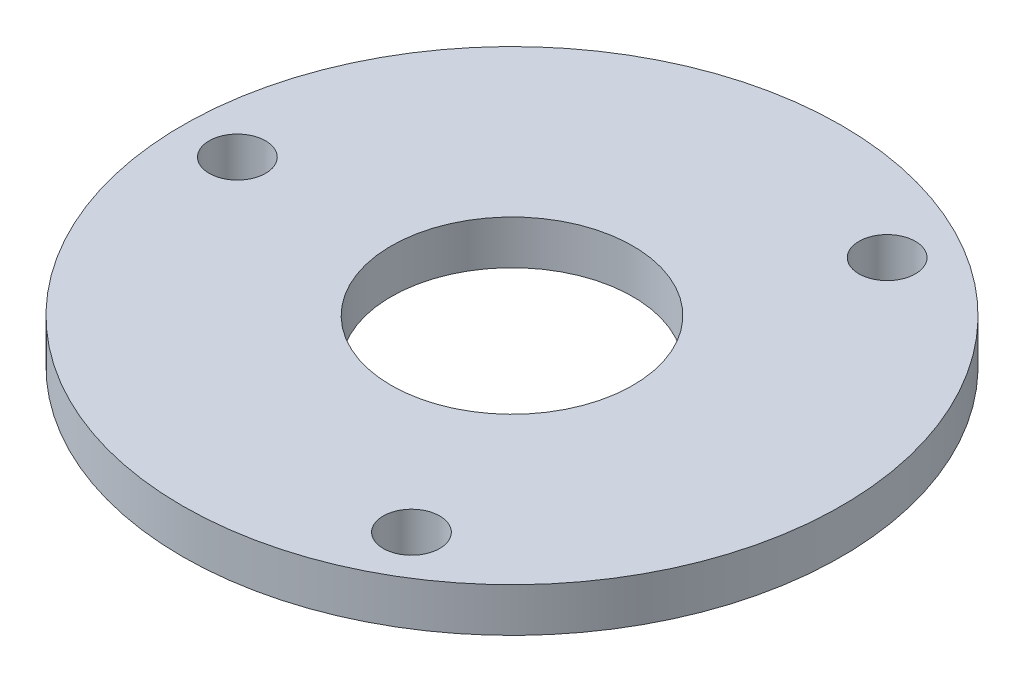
from build123d import *

# Parameters (mm, degrees)
SKETCH1_R             = 19.05
SKETCH1_R_2           = 6.985
BOSS_EXTRUDE1_DEPTH   = 2.54
F_4_CLEARANCE_HOLE1_D = 3.2639
CIRPATTERN1_COUNT     = 3


with BuildPart() as part:
    # Sketch1 → Boss-Extrude1 (new body)
    with BuildSketch(Plane(origin=(0, 0, 0), x_dir=(1, 0, 0), z_dir=(0, 1, 0))):
        with Locations(Location((0, 0, 0), (0, 0, 270))):
            Circle(SKETCH1_R)
        with Locations(Location((0, 0, 0), (0, 0, 270))):
            Circle(SKETCH1_R_2, mode=Mode.SUBTRACT)
    extrude(amount=BOSS_EXTRUDE1_DEPTH)

    # 4 Clearance Hole1 (through all)
    with Locations(Plane(origin=(0, 2.54, 0), x_dir=(1, 0, 0), z_dir=(0, 1, 0))):
        with Locations((-15.875, 0)):
            f_4_clearance_hole1 = Hole(F_4_CLEARANCE_HOLE1_D / 2)

    # CirPattern1: 4 Clearance Hole1 ×3 about axis
    cirpattern1_axis = Axis((0, 0, 0), (0, 1, 0))
    for i in range(1, CIRPATTERN1_COUNT):
        add(f_4_clearance_hole1.rotate(cirpattern1_axis, i * 360 / CIRPATTERN1_COUNT), mode=Mode.SUBTRACT)


solid = part.part
